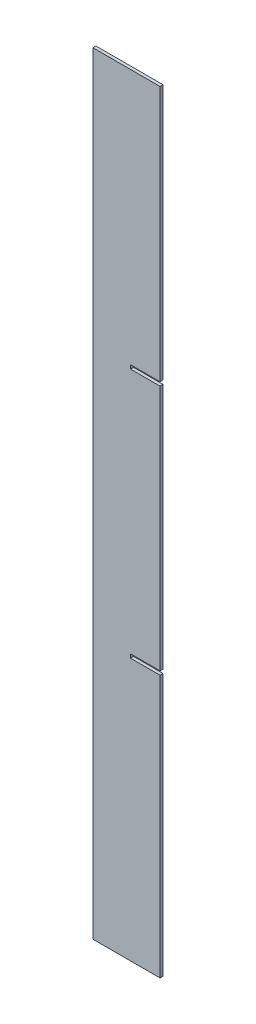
from build123d import *

# Parameters (mm, degrees)
EXTRUDE_1_DEPTH = 2


with BuildPart() as part:
    # Model → Extrude 1 (new body)
    with BuildSketch(Plane.XY):
        Polygon((-4475.8372, 581.037), (-4475.8372, 583.037), (-4475.8372, 583.2869), (-4456.129, 583.2869), (-4456.129, 753.8775), (-4500.8945, 753.8775), (-4500.8946, 238.8775), (-4456.1291, 238.8775), (-4456.129, 413.787), (-4475.8372, 413.787), (-4475.8372, 414.0371), (-4475.8372, 416.0371), (-4475.8372, 416.287), (-4456.129, 416.287), (-4456.129, 580.7869), (-4475.8372, 580.7869), align=None)
    extrude(amount=EXTRUDE_1_DEPTH)


solid = part.part
